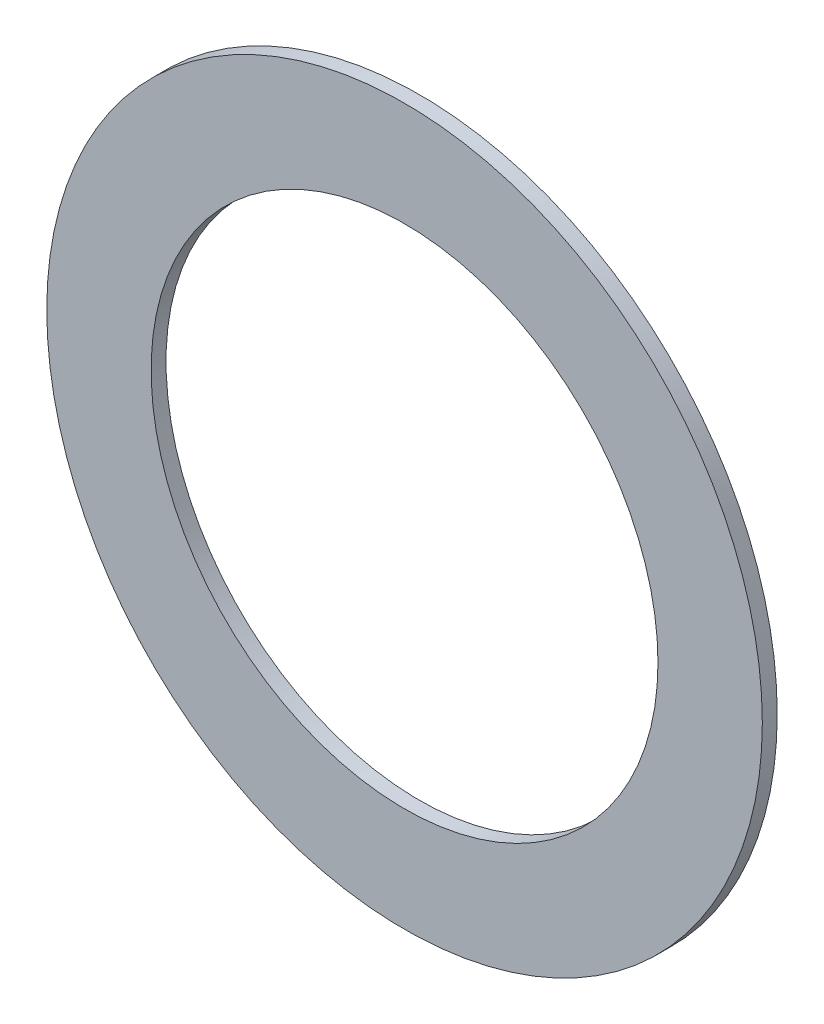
ISO-10303-21;
HEADER;
FILE_DESCRIPTION(('STEP AP214'),'2;1');
FILE_NAME('part.step','',(''),(''),'','','');
FILE_SCHEMA(('AUTOMOTIVE_DESIGN { 1 0 10303 214 1 1 1 1 }'));
ENDSEC;
DATA;
#1=APPLICATION_CONTEXT('core data for automotive mechanical design processes');
#2=APPLICATION_PROTOCOL_DEFINITION('international standard','automotive_design',2000,#1);
#3=PRODUCT_CONTEXT('',#1,'mechanical');
#4=PRODUCT('Part','Part','',(#3));
#5=PRODUCT_RELATED_PRODUCT_CATEGORY('part','',(#4));
#6=PRODUCT_DEFINITION_FORMATION('','',#4);
#7=PRODUCT_DEFINITION_CONTEXT('part definition',#1,'design');
#8=PRODUCT_DEFINITION('design','',#6,#7);
#9=PRODUCT_DEFINITION_SHAPE('','',#8);
#10=(LENGTH_UNIT() NAMED_UNIT(*) SI_UNIT(.MILLI.,.METRE.));
#11=(NAMED_UNIT(*) PLANE_ANGLE_UNIT() SI_UNIT($,.RADIAN.));
#12=(NAMED_UNIT(*) SI_UNIT($,.STERADIAN.) SOLID_ANGLE_UNIT());
#13=UNCERTAINTY_MEASURE_WITH_UNIT(LENGTH_MEASURE(1.E-05),#10,'distance_accuracy_value','');
#14=(GEOMETRIC_REPRESENTATION_CONTEXT(3) GLOBAL_UNCERTAINTY_ASSIGNED_CONTEXT((#13)) GLOBAL_UNIT_ASSIGNED_CONTEXT((#10,
#11,#12)) REPRESENTATION_CONTEXT('',''));
#15=CARTESIAN_POINT('',(0.,0.,0.));
#16=DIRECTION('',(0.,0.,1.));
#17=DIRECTION('',(1.,0.,0.));
#18=AXIS2_PLACEMENT_3D('',#15,#16,#17);
#19=CARTESIAN_POINT('',(0.,0.,0.5));
#20=DIRECTION('',(0.,0.,1.));
#21=DIRECTION('',(1.,0.,0.));
#22=AXIS2_PLACEMENT_3D('',#19,#20,#21);
#23=PLANE('',#22);
#24=CARTESIAN_POINT('',(0.,0.,0.5));
#25=DIRECTION('',(0.,0.,1.));
#26=DIRECTION('',(1.,0.,0.));
#27=AXIS2_PLACEMENT_3D('',#24,#25,#26);
#28=CIRCLE('',#27,12.);
#29=CARTESIAN_POINT('',(12.,0.,0.5));
#30=VERTEX_POINT('',#29);
#31=EDGE_CURVE('E10',#30,#30,#28,.T.);
#32=ORIENTED_EDGE('',*,*,#31,.T.);
#33=EDGE_LOOP('',(#32));
#34=FACE_BOUND('',#33,.T.);
#35=CARTESIAN_POINT('',(0.,0.,0.5));
#36=DIRECTION('',(0.,0.,1.));
#37=DIRECTION('',(1.,0.,0.));
#38=AXIS2_PLACEMENT_3D('',#35,#36,#37);
#39=CIRCLE('',#38,8.5);
#40=CARTESIAN_POINT('',(8.5,0.,0.5));
#41=VERTEX_POINT('',#40);
#42=EDGE_CURVE('E45',#41,#41,#39,.T.);
#43=ORIENTED_EDGE('',*,*,#42,.F.);
#44=EDGE_LOOP('',(#43));
#45=FACE_BOUND('',#44,.T.);
#46=ADVANCED_FACE('F34',(#34,#45),#23,.T.);
#47=CARTESIAN_POINT('',(0.,0.,0.));
#48=DIRECTION('',(0.,0.,1.));
#49=DIRECTION('',(1.,0.,0.));
#50=AXIS2_PLACEMENT_3D('',#47,#48,#49);
#51=PLANE('',#50);
#52=CARTESIAN_POINT('',(0.,0.,0.));
#53=DIRECTION('',(0.,0.,1.));
#54=DIRECTION('',(1.,0.,0.));
#55=AXIS2_PLACEMENT_3D('',#52,#53,#54);
#56=CIRCLE('',#55,12.);
#57=CARTESIAN_POINT('',(12.,0.,0.));
#58=VERTEX_POINT('',#57);
#59=EDGE_CURVE('E41',#58,#58,#56,.T.);
#60=ORIENTED_EDGE('',*,*,#59,.F.);
#61=EDGE_LOOP('',(#60));
#62=FACE_BOUND('',#61,.T.);
#63=CARTESIAN_POINT('',(0.,0.,0.));
#64=DIRECTION('',(0.,0.,1.));
#65=DIRECTION('',(1.,0.,0.));
#66=AXIS2_PLACEMENT_3D('',#63,#64,#65);
#67=CIRCLE('',#66,8.5);
#68=CARTESIAN_POINT('',(8.5,0.,0.));
#69=VERTEX_POINT('',#68);
#70=EDGE_CURVE('E49',#69,#69,#67,.T.);
#71=ORIENTED_EDGE('',*,*,#70,.T.);
#72=EDGE_LOOP('',(#71));
#73=FACE_BOUND('',#72,.T.);
#74=ADVANCED_FACE('F55',(#62,#73),#51,.F.);
#75=CARTESIAN_POINT('',(0.,0.,0.5));
#76=DIRECTION('',(0.,0.,-1.));
#77=DIRECTION('',(-1.,0.,0.));
#78=AXIS2_PLACEMENT_3D('',#75,#76,#77);
#79=CYLINDRICAL_SURFACE('',#78,12.);
#80=ORIENTED_EDGE('',*,*,#31,.F.);
#81=EDGE_LOOP('',(#80));
#82=FACE_BOUND('',#81,.T.);
#83=ORIENTED_EDGE('',*,*,#59,.T.);
#84=EDGE_LOOP('',(#83));
#85=FACE_BOUND('',#84,.T.);
#86=ADVANCED_FACE('F36',(#82,#85),#79,.T.);
#87=CARTESIAN_POINT('',(0.,0.,0.5));
#88=DIRECTION('',(0.,0.,-1.));
#89=DIRECTION('',(-1.,0.,0.));
#90=AXIS2_PLACEMENT_3D('',#87,#88,#89);
#91=CYLINDRICAL_SURFACE('',#90,8.5);
#92=ORIENTED_EDGE('',*,*,#42,.T.);
#93=EDGE_LOOP('',(#92));
#94=FACE_BOUND('',#93,.T.);
#95=ORIENTED_EDGE('',*,*,#70,.F.);
#96=EDGE_LOOP('',(#95));
#97=FACE_BOUND('',#96,.T.);
#98=ADVANCED_FACE('F57',(#94,#97),#91,.F.);
#99=CLOSED_SHELL('',(#46,#74,#86,#98));
#100=MANIFOLD_SOLID_BREP('B2',#99);
#101=ADVANCED_BREP_SHAPE_REPRESENTATION('',(#18,#100),#14);
#102=SHAPE_DEFINITION_REPRESENTATION(#9,#101);
ENDSEC;
END-ISO-10303-21;
